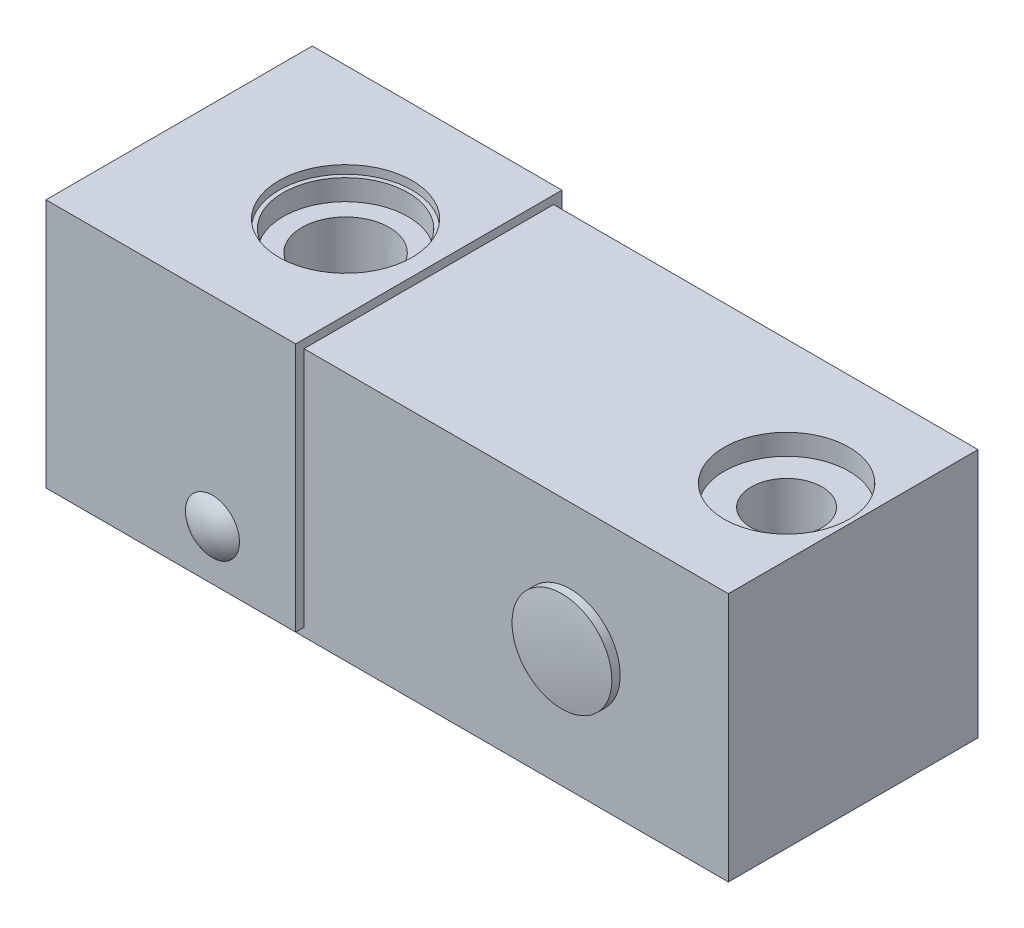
from build123d import *
from build123d.topology import SkipClean

# Parameters (mm, degrees)
EXTRUDE1_DEPTH           = 31
CUT_EXTRUDE1_DEPTH       = 15
CUT_EXTRUDE1_DEPTH_BACK  = 15
SKETCH2_W                = 51
SKETCH2_H                = 2
CUT_EXTRUDE2_DEPTH       = 15
CUT_EXTRUDE2_DEPTH_BACK  = 15
SKETCH3_W                = 15
SKETCH3_H                = 30
SKETCH4_W                = 2
SKETCH4_H                = 1
CUT_EXTRUDE3_DEPTH       = 30
SKETCH5_W                = 2
SKETCH5_H                = 1
CUT_EXTRUDE4_DEPTH       = 30
SKETCH7_W                = 4.25
SKETCH7_H                = 30
SKETCH8_W                = 7.5
SKETCH8_H                = 2.5
SKETCH14_W               = 7.5
SKETCH14_H               = 2.5
CUT_EXTRUDE5_DEPTH       = 5
REVOLVE3_ANGLE           = 90
REVOLVE3_OTHER_WAY_ANGLE = 90
REVOLVE4_ANGLE           = 90
REVOLVE4_OTHER_WAY_ANGLE = 90


with BuildPart() as part:
    # Sketch1 → Extrude1 (new body)
    with BuildSketch(Plane(origin=(0, 0, 0), x_dir=(-1, 0, 0), z_dir=(0, 1, 0))):
        Polygon((30, 16), (0, 16), (0, 15), (-51, 15), (-51, -15), (0, -15), (0, -16), (30, -16), align=None)
    extrude(amount=EXTRUDE1_DEPTH)

    # Sketch2 → Cut-Extrude1 (cut, two sides: drawn at the far end of the back side and taken through both)
    with BuildSketch(Plane.XY.offset(-CUT_EXTRUDE1_DEPTH_BACK)):
        with Locations((25.5, 31)):
            Rectangle(SKETCH2_W, SKETCH2_H)
    extrude(amount=CUT_EXTRUDE1_DEPTH + CUT_EXTRUDE1_DEPTH_BACK, mode=Mode.SUBTRACT)

    # Sketch3 → Cut-Extrude2 (cut, two sides: drawn at the far end of the back side and taken through both)
    with BuildSketch(Plane.XY.offset(-CUT_EXTRUDE2_DEPTH_BACK)):
        with Locations((-30.5, 15)):
            Rectangle(SKETCH3_W, SKETCH3_H)
    extrude(amount=CUT_EXTRUDE2_DEPTH + CUT_EXTRUDE2_DEPTH_BACK, mode=Mode.SUBTRACT)

    # Sketch4 → Cut-Extrude3 (cut)
    with BuildSketch(Plane(origin=(0, 0, 0), x_dir=(0, 0, -1), z_dir=(1, 0, 0))):
        with Locations((-16, 0.5)):
            Rectangle(SKETCH4_W, SKETCH4_H)
    extrude(amount=-CUT_EXTRUDE3_DEPTH, mode=Mode.SUBTRACT)

    # Sketch5 → Cut-Extrude4 (cut)
    with BuildSketch(Plane(origin=(0, 0, 0), x_dir=(0, 0, -1), z_dir=(1, 0, 0))):
        with Locations((16, 0.5)):
            Rectangle(SKETCH5_W, SKETCH5_H)
    extrude(amount=-CUT_EXTRUDE4_DEPTH, mode=Mode.SUBTRACT)

    # Sketch6 → Cut-Revolve1 (revolve, cut)
    with BuildSketch(Plane.XY, mode=Mode.PRIVATE) as cut_revolve1_sk:
        Polygon((-40.5, 12.5), (-40.5, 21.5), (9.5, 21.5), (9.5, 18.5), (32.5, 18.5), (35.297845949, 12.5), align=None)
    revolve(cut_revolve1_sk.sketch.rotate(Axis((35.297845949, 12.5, 0), (-1, 0, 0)), 270), axis=Axis((35.297845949, 12.5, 0), (-1, 0, 0)), mode=Mode.SUBTRACT)

    # Sketch7 → Cut-Revolve2 (revolve, cut)
    with BuildSketch(Plane.XY, mode=Mode.PRIVATE) as cut_revolve2_sk:
        with Locations((45.125, 15)):
            Rectangle(SKETCH7_W, SKETCH7_H)
    revolve(cut_revolve2_sk.sketch.rotate(Axis((43, 0, 0), (0, 1, 0)), 270), axis=Axis((43, 0, 0), (0, 1, 0)), mode=Mode.SUBTRACT)

    # Sketch8 → Cut-Revolve3 (revolve, cut)
    with BuildSketch(Plane.XY, mode=Mode.PRIVATE) as cut_revolve3_sk:
        with Locations((46.75, 28.75)):
            Rectangle(SKETCH8_W, SKETCH8_H)
    revolve(cut_revolve3_sk.sketch.rotate(Axis((43, 27.5, 0), (0, 1, 0)), 270), axis=Axis((43, 27.5, 0), (0, 1, 0)), mode=Mode.SUBTRACT)

    # Sketch9 → Cut-Revolve4 (revolve, cut)
    with BuildSketch(Plane.XY.offset(11), mode=Mode.PRIVATE) as cut_revolve4_sk:
        Polygon((43, 10.193383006), (45.067, 9), (45.067, 0.433), (45.5, 0), (43, 0), align=None)
    revolve(cut_revolve4_sk.sketch.rotate(Axis((43, 0, 11), (0, 1, 0)), 270), axis=Axis((43, 0, 11), (0, 1, 0)), mode=Mode.SUBTRACT)

    # Sketch10 → Cut-Revolve5 (revolve, cut)
    with BuildSketch(Plane.XY.offset(11), mode=Mode.PRIVATE) as cut_revolve5_sk:
        Polygon((-16, 10.193383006), (-13.933, 9), (-13.933, 0.433), (-13.5, 0), (-16, 0), align=None)
    revolve(cut_revolve5_sk.sketch.rotate(Axis((-16, 0, 11), (0, 1, 0)), 270), axis=Axis((-16, 0, 11), (0, 1, 0)), mode=Mode.SUBTRACT)

    # Sketch11 → Cut-Revolve6 (revolve, cut)
    with BuildSketch(Plane.XY.offset(-11), mode=Mode.PRIVATE) as cut_revolve6_sk:
        Polygon((43, 10.193383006), (45.067, 9), (45.067, 0.433), (45.5, 0), (43, 0), align=None)
    revolve(cut_revolve6_sk.sketch.rotate(Axis((43, 0, -11), (0, 1, 0)), 270), axis=Axis((43, 0, -11), (0, 1, 0)), mode=Mode.SUBTRACT)

    # Sketch12 → Cut-Revolve7 (revolve, cut)
    with BuildSketch(Plane.XY.offset(-11), mode=Mode.PRIVATE) as cut_revolve7_sk:
        Polygon((-16, 10.193383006), (-13.933, 9), (-13.933, 0.433), (-13.5, 0), (-16, 0), align=None)
    revolve(cut_revolve7_sk.sketch.rotate(Axis((-16, 0, -11), (0, 1, 0)), 270), axis=Axis((-16, 0, -11), (0, 1, 0)), mode=Mode.SUBTRACT)

    # Sketch13 → Cut-Revolve8 (revolve, cut)
    with BuildSketch(Plane.XY, mode=Mode.PRIVATE) as cut_revolve8_sk:
        Polygon((-10, 31), (-2, 31), (-2, 30), (-4.75, 30), (-4.75, 0), (-10, 0), align=None)
    revolve(cut_revolve8_sk.sketch.rotate(Axis((-10, 0, 0), (0, 1, 0)), 270), axis=Axis((-10, 0, 0), (0, 1, 0)), mode=Mode.SUBTRACT)

    # Sketch14 → Cut-Revolve9 (revolve, cut)
    with BuildSketch(Plane.XY, mode=Mode.PRIVATE) as cut_revolve9_sk:
        with Locations((-6.25, 28.75)):
            Rectangle(SKETCH14_W, SKETCH14_H)
    revolve(cut_revolve9_sk.sketch.rotate(Axis((-10, 27.5, 0), (0, 1, 0)), 270), axis=Axis((-10, 27.5, 0), (0, 1, 0)), mode=Mode.SUBTRACT)

    # Sketch15 → Cut-Revolve10 (revolve, cut)
    with BuildSketch(Plane(origin=(32, 0, 0), x_dir=(0, 0, -1), z_dir=(1, 0, 0)), mode=Mode.PRIVATE) as cut_revolve10_sk:
        Polygon((15, 15), (15, 10.136), (14.419, 10.717), (-14.419, 10.717), (-15, 10.136), (-15, 15), align=None)
    revolve(cut_revolve10_sk.sketch.rotate(Axis((32, 15, 15), (0, 0, -1)), 90), axis=Axis((32, 15, 15), (0, 0, -1)), mode=Mode.SUBTRACT)

    # Sketch16 → Revolve1 (revolve)
    with BuildSketch(Plane(origin=(32, 0, 0), x_dir=(0, 0, -1), z_dir=(1, 0, 0)), mode=Mode.PRIVATE) as revolve1_sk:
        with BuildLine():
            Line((-9, 15), (-9, 10.717))
            Line((-9, 10.717), (-15, 10.717))
            Line((-15, 10.717), (-15, 9))
            Line((-15, 9), (-16, 9))
            ThreePointArc((-16, 9), (-16.339259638, 11.991478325), (-16.452560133, 15))
            Line((-16.452560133, 15), (-9, 15))
        make_face()
    revolve(revolve1_sk.sketch.rotate(Axis((32, 15, 16.452560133), (0, 0, -1)), 90), axis=Axis((32, 15, 16.452560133), (0, 0, -1)))

    # Sketch17 → Revolve2 (revolve)
    with BuildSketch(Plane(origin=(32, 0, 0), x_dir=(0, 0, -1), z_dir=(1, 0, 0)), mode=Mode.PRIVATE) as revolve2_sk:
        Polygon((17, 15), (17, 6), (15, 6), (15, 8.4215), (5, 8.4215), (5, 15), align=None)
    revolve(revolve2_sk.sketch.rotate(Axis((32, 15, -5), (0, 0, -1)), 180), axis=Axis((32, 15, -5), (0, 0, -1)))

    # Sketch18 → Cut-Extrude5 (cut)
    with BuildSketch(Plane(origin=(0, 0, -17), x_dir=(-1, 0, 0), z_dir=(0, 0, -1))):
        Polygon((-29.979274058, 18.5), (-34.020725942, 18.5), (-36.041451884, 15), (-34.020725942, 11.5), (-29.979274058, 11.5), (-27.958548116, 15), align=None)
    extrude(amount=-CUT_EXTRUDE5_DEPTH, mode=Mode.SUBTRACT)

    # Sketch19 → Revolve3 (revolve)
    with BuildSketch(Plane(origin=(-10, 0, 0), x_dir=(0, 0, -1), z_dir=(1, 0, 0))):
        with BuildLine():
            Line((-12.2, 12), (-12.2, 2))
            ThreePointArc((-12.2, 2), (-17.2, 7), (-12.2, 12))
        make_face()
    revolve(axis=Axis((-10, 12, 12.2), (0, -1, 0)), revolution_arc=REVOLVE3_ANGLE)

    # Sketch19 → Revolve3 other way (revolve)
    with SkipClean():  # the faces are left unmerged after this step: merging them gives an invalid solid
        with BuildSketch(Plane(origin=(-10, 0, 0), x_dir=(0, 0, -1), z_dir=(1, 0, 0))):
            with BuildLine():
                Line((-12.2, 12), (-12.2, 2))
                ThreePointArc((-12.2, 2), (-17.2, 7), (-12.2, 12))
            make_face()
        revolve(axis=Axis((-10, 12, 12.2), (0, 1, 0)), revolution_arc=REVOLVE3_OTHER_WAY_ANGLE)

    # Sketch20 → Revolve4 (revolve)
    with SkipClean():  # the faces are left unmerged after this step: merging them gives an invalid solid
        with BuildSketch(Plane(origin=(-10, 0, 0), x_dir=(0, 0, -1), z_dir=(1, 0, 0))):
            with BuildLine():
                Line((12.2, 2), (12.2, 12))
                ThreePointArc((12.2, 12), (17.2, 7), (12.2, 2))
            make_face()
        revolve(axis=Axis((-10, 2, -12.2), (0, 1, 0)), revolution_arc=REVOLVE4_ANGLE)

    # Sketch20 → Revolve4 other way (revolve)
    with SkipClean():  # the faces are left unmerged after this step: merging them gives an invalid solid
        with BuildSketch(Plane(origin=(-10, 0, 0), x_dir=(0, 0, -1), z_dir=(1, 0, 0))):
            with BuildLine():
                Line((12.2, 2), (12.2, 12))
                ThreePointArc((12.2, 12), (17.2, 7), (12.2, 2))
            make_face()
        revolve(axis=Axis((-10, 2, -12.2), (0, -1, 0)), revolution_arc=REVOLVE4_OTHER_WAY_ANGLE)

    # Sketch21 → Cut-Revolve11 (revolve, cut)
    with SkipClean():  # the faces are left unmerged after this step: merging them gives an invalid solid
        with BuildSketch(Plane.XY, mode=Mode.PRIVATE) as cut_revolve11_sk:
            Polygon((30, 15), (32, 15), (32, 1.6), (34.25, 1.6), (34.25, 0), (30, 0), align=None)
        revolve(cut_revolve11_sk.sketch.rotate(Axis((30, 0, 0), (0, 1, 0)), 270), axis=Axis((30, 0, 0), (0, 1, 0)), mode=Mode.SUBTRACT)


solid = part.part
